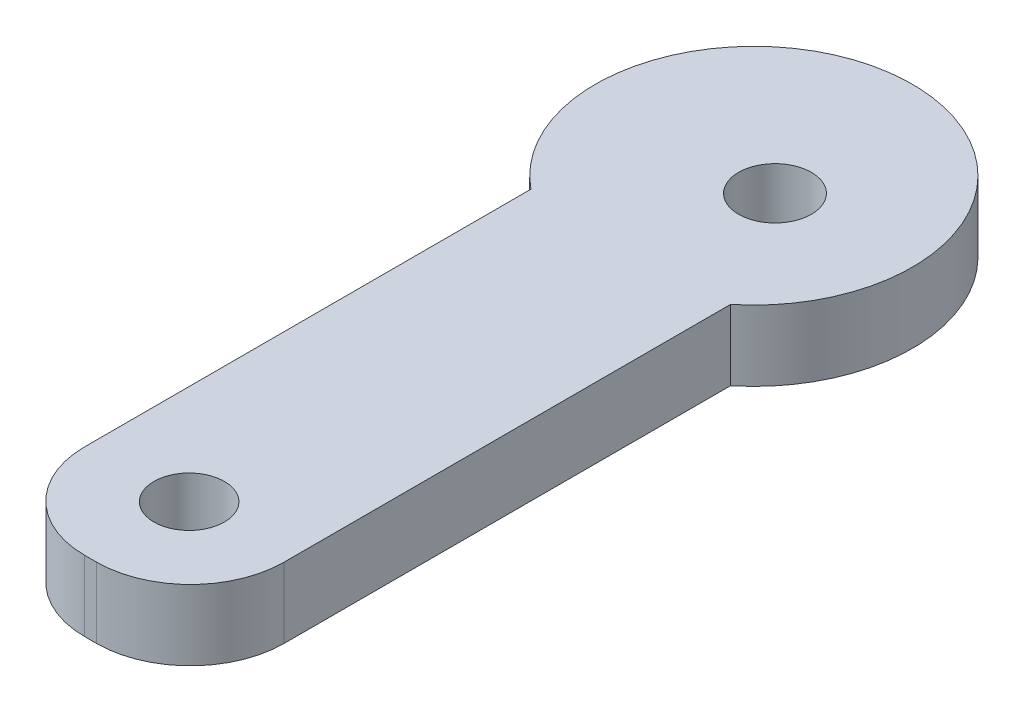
ISO-10303-21;
HEADER;
FILE_DESCRIPTION(('STEP AP214'),'2;1');
FILE_NAME('part.step','',(''),(''),'','','');
FILE_SCHEMA(('AUTOMOTIVE_DESIGN { 1 0 10303 214 1 1 1 1 }'));
ENDSEC;
DATA;
#1=APPLICATION_CONTEXT('core data for automotive mechanical design processes');
#2=APPLICATION_PROTOCOL_DEFINITION('international standard','automotive_design',2000,#1);
#3=PRODUCT_CONTEXT('',#1,'mechanical');
#4=PRODUCT('Part','Part','',(#3));
#5=PRODUCT_RELATED_PRODUCT_CATEGORY('part','',(#4));
#6=PRODUCT_DEFINITION_FORMATION('','',#4);
#7=PRODUCT_DEFINITION_CONTEXT('part definition',#1,'design');
#8=PRODUCT_DEFINITION('design','',#6,#7);
#9=PRODUCT_DEFINITION_SHAPE('','',#8);
#10=(LENGTH_UNIT() NAMED_UNIT(*) SI_UNIT(.MILLI.,.METRE.));
#11=(NAMED_UNIT(*) PLANE_ANGLE_UNIT() SI_UNIT($,.RADIAN.));
#12=(NAMED_UNIT(*) SI_UNIT($,.STERADIAN.) SOLID_ANGLE_UNIT());
#13=UNCERTAINTY_MEASURE_WITH_UNIT(LENGTH_MEASURE(1.E-05),#10,'distance_accuracy_value','');
#14=(GEOMETRIC_REPRESENTATION_CONTEXT(3) GLOBAL_UNCERTAINTY_ASSIGNED_CONTEXT((#13)) GLOBAL_UNIT_ASSIGNED_CONTEXT((#10,
#11,#12)) REPRESENTATION_CONTEXT('',''));
#15=CARTESIAN_POINT('',(0.,0.,0.));
#16=DIRECTION('',(0.,0.,1.));
#17=DIRECTION('',(1.,0.,0.));
#18=AXIS2_PLACEMENT_3D('',#15,#16,#17);
#19=CARTESIAN_POINT('',(-0.25,-1.5,17.5));
#20=DIRECTION('',(0.,0.,1.));
#21=DIRECTION('',(1.,0.,0.));
#22=AXIS2_PLACEMENT_3D('',#19,#20,#21);
#23=PLANE('',#22);
#24=DIRECTION('',(0.,1.,0.));
#25=VECTOR('',#24,1.);
#26=CARTESIAN_POINT('',(-0.25,-1.5,17.5));
#27=LINE('',#26,#25);
#28=CARTESIAN_POINT('',(-0.25,-1.5,17.5));
#29=VERTEX_POINT('',#28);
#30=CARTESIAN_POINT('',(-0.25,1.5,17.5));
#31=VERTEX_POINT('',#30);
#32=EDGE_CURVE('E117',#29,#31,#27,.T.);
#33=ORIENTED_EDGE('',*,*,#32,.F.);
#34=DIRECTION('',(1.,0.,0.));
#35=VECTOR('',#34,1.);
#36=CARTESIAN_POINT('',(-0.25,-1.5,17.5));
#37=LINE('',#36,#35);
#38=CARTESIAN_POINT('',(0.25,-1.5,17.5));
#39=VERTEX_POINT('',#38);
#40=EDGE_CURVE('E35',#29,#39,#37,.T.);
#41=ORIENTED_EDGE('',*,*,#40,.T.);
#42=DIRECTION('',(0.,1.,0.));
#43=VECTOR('',#42,1.);
#44=CARTESIAN_POINT('',(0.25,-1.5,17.5));
#45=LINE('',#44,#43);
#46=CARTESIAN_POINT('',(0.25,1.5,17.5));
#47=VERTEX_POINT('',#46);
#48=EDGE_CURVE('E86',#47,#39,#45,.F.);
#49=ORIENTED_EDGE('',*,*,#48,.F.);
#50=DIRECTION('',(1.,0.,0.));
#51=VECTOR('',#50,1.);
#52=CARTESIAN_POINT('',(0.,1.5,17.5));
#53=LINE('',#52,#51);
#54=EDGE_CURVE('E73',#31,#47,#53,.T.);
#55=ORIENTED_EDGE('',*,*,#54,.F.);
#56=EDGE_LOOP('',(#33,#41,#49,#55));
#57=FACE_BOUND('',#56,.T.);
#58=ADVANCED_FACE('F17',(#57),#23,.T.);
#59=CARTESIAN_POINT('',(0.,1.5,0.));
#60=DIRECTION('',(0.,1.,0.));
#61=DIRECTION('',(0.,0.,1.));
#62=AXIS2_PLACEMENT_3D('',#59,#60,#61);
#63=PLANE('',#62);
#64=CARTESIAN_POINT('',(1.1,1.5,-10.55));
#65=DIRECTION('',(0.,1.,0.));
#66=DIRECTION('',(0.,0.,1.));
#67=AXIS2_PLACEMENT_3D('',#64,#65,#66);
#68=CIRCLE('',#67,1.55);
#69=CARTESIAN_POINT('',(1.1,1.5,-9.));
#70=VERTEX_POINT('',#69);
#71=EDGE_CURVE('E110',#70,#70,#68,.F.);
#72=ORIENTED_EDGE('',*,*,#71,.T.);
#73=EDGE_LOOP('',(#72));
#74=FACE_BOUND('',#73,.T.);
#75=CARTESIAN_POINT('',(0.,1.5,13.3));
#76=DIRECTION('',(0.,1.,0.));
#77=DIRECTION('',(0.,0.,1.));
#78=AXIS2_PLACEMENT_3D('',#75,#76,#77);
#79=CIRCLE('',#78,1.5);
#80=CARTESIAN_POINT('',(0.,1.5,14.8));
#81=VERTEX_POINT('',#80);
#82=EDGE_CURVE('E113',#81,#81,#79,.F.);
#83=ORIENTED_EDGE('',*,*,#82,.T.);
#84=EDGE_LOOP('',(#83));
#85=FACE_BOUND('',#84,.T.);
#86=ORIENTED_EDGE('',*,*,#54,.T.);
#87=CARTESIAN_POINT('',(0.25,1.5,13.5));
#88=DIRECTION('',(0.,1.,0.));
#89=DIRECTION('',(0.,0.,1.));
#90=AXIS2_PLACEMENT_3D('',#87,#88,#89);
#91=CIRCLE('',#90,4.);
#92=CARTESIAN_POINT('',(4.25,1.5,13.5));
#93=VERTEX_POINT('',#92);
#94=EDGE_CURVE('E20',#93,#47,#91,.F.);
#95=ORIENTED_EDGE('',*,*,#94,.F.);
#96=DIRECTION('',(0.,0.,-1.));
#97=VECTOR('',#96,1.);
#98=CARTESIAN_POINT('',(4.25,1.5,13.5));
#99=LINE('',#98,#97);
#100=CARTESIAN_POINT('',(4.24999999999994,1.5,-5.5059557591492));
#101=VERTEX_POINT('',#100);
#102=EDGE_CURVE('E67',#101,#93,#99,.F.);
#103=ORIENTED_EDGE('',*,*,#102,.F.);
#104=CARTESIAN_POINT('',(0.,1.5,-10.75));
#105=DIRECTION('',(0.,1.,0.));
#106=DIRECTION('',(0.,0.,1.));
#107=AXIS2_PLACEMENT_3D('',#104,#105,#106);
#108=CIRCLE('',#107,6.75);
#109=CARTESIAN_POINT('',(-4.25,1.5,-5.50595575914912));
#110=VERTEX_POINT('',#109);
#111=EDGE_CURVE('E118',#110,#101,#108,.F.);
#112=ORIENTED_EDGE('',*,*,#111,.F.);
#113=DIRECTION('',(0.,0.,1.));
#114=VECTOR('',#113,1.);
#115=CARTESIAN_POINT('',(-4.25,1.5,-5.505955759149));
#116=LINE('',#115,#114);
#117=CARTESIAN_POINT('',(-4.25,1.5,13.5));
#118=VERTEX_POINT('',#117);
#119=EDGE_CURVE('E93',#118,#110,#116,.F.);
#120=ORIENTED_EDGE('',*,*,#119,.F.);
#121=CARTESIAN_POINT('',(-0.25,1.5,13.5));
#122=DIRECTION('',(0.,1.,0.));
#123=DIRECTION('',(0.,0.,1.));
#124=AXIS2_PLACEMENT_3D('',#121,#122,#123);
#125=CIRCLE('',#124,4.);
#126=EDGE_CURVE('E78',#31,#118,#125,.F.);
#127=ORIENTED_EDGE('',*,*,#126,.F.);
#128=EDGE_LOOP('',(#86,#95,#103,#112,#120,#127));
#129=FACE_BOUND('',#128,.T.);
#130=ADVANCED_FACE('F75',(#74,#85,#129),#63,.T.);
#131=CARTESIAN_POINT('',(0.25,-1.5,13.5));
#132=DIRECTION('',(0.,1.,0.));
#133=DIRECTION('',(0.,0.,1.));
#134=AXIS2_PLACEMENT_3D('',#131,#132,#133);
#135=CYLINDRICAL_SURFACE('',#134,4.);
#136=ORIENTED_EDGE('',*,*,#48,.T.);
#137=CARTESIAN_POINT('',(0.25,-1.5,13.5));
#138=DIRECTION('',(0.,1.,0.));
#139=DIRECTION('',(0.,0.,1.));
#140=AXIS2_PLACEMENT_3D('',#137,#138,#139);
#141=CIRCLE('',#140,4.);
#142=CARTESIAN_POINT('',(4.25,-1.5,13.5));
#143=VERTEX_POINT('',#142);
#144=EDGE_CURVE('E108',#39,#143,#141,.T.);
#145=ORIENTED_EDGE('',*,*,#144,.T.);
#146=DIRECTION('',(0.,1.,0.));
#147=VECTOR('',#146,1.);
#148=CARTESIAN_POINT('',(4.25,-1.5,13.5));
#149=LINE('',#148,#147);
#150=EDGE_CURVE('E87',#93,#143,#149,.F.);
#151=ORIENTED_EDGE('',*,*,#150,.F.);
#152=ORIENTED_EDGE('',*,*,#94,.T.);
#153=EDGE_LOOP('',(#136,#145,#151,#152));
#154=FACE_BOUND('',#153,.T.);
#155=ADVANCED_FACE('F84',(#154),#135,.T.);
#156=CARTESIAN_POINT('',(4.25,-1.5,13.5));
#157=DIRECTION('',(1.,0.,0.));
#158=DIRECTION('',(0.,0.,-1.));
#159=AXIS2_PLACEMENT_3D('',#156,#157,#158);
#160=PLANE('',#159);
#161=ORIENTED_EDGE('',*,*,#150,.T.);
#162=DIRECTION('',(0.,0.,1.));
#163=VECTOR('',#162,1.);
#164=CARTESIAN_POINT('',(4.25,-1.5,0.));
#165=LINE('',#164,#163);
#166=CARTESIAN_POINT('',(4.24999999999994,-1.5,-5.5059557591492));
#167=VERTEX_POINT('',#166);
#168=EDGE_CURVE('E107',#143,#167,#165,.F.);
#169=ORIENTED_EDGE('',*,*,#168,.T.);
#170=DIRECTION('',(0.,1.,0.));
#171=VECTOR('',#170,1.);
#172=CARTESIAN_POINT('',(4.24999999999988,-1.5,-5.50595575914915));
#173=LINE('',#172,#171);
#174=EDGE_CURVE('E96',#101,#167,#173,.F.);
#175=ORIENTED_EDGE('',*,*,#174,.F.);
#176=ORIENTED_EDGE('',*,*,#102,.T.);
#177=EDGE_LOOP('',(#161,#169,#175,#176));
#178=FACE_BOUND('',#177,.T.);
#179=ADVANCED_FACE('F124',(#178),#160,.T.);
#180=CARTESIAN_POINT('',(0.,-1.5,-10.75));
#181=DIRECTION('',(0.,1.,0.));
#182=DIRECTION('',(0.,0.,1.));
#183=AXIS2_PLACEMENT_3D('',#180,#181,#182);
#184=CYLINDRICAL_SURFACE('',#183,6.75);
#185=ORIENTED_EDGE('',*,*,#174,.T.);
#186=CARTESIAN_POINT('',(0.,-1.5,-10.75));
#187=DIRECTION('',(0.,1.,0.));
#188=DIRECTION('',(0.,0.,1.));
#189=AXIS2_PLACEMENT_3D('',#186,#187,#188);
#190=CIRCLE('',#189,6.75);
#191=CARTESIAN_POINT('',(-4.25,-1.5,-5.50595575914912));
#192=VERTEX_POINT('',#191);
#193=EDGE_CURVE('E104',#167,#192,#190,.T.);
#194=ORIENTED_EDGE('',*,*,#193,.T.);
#195=DIRECTION('',(0.,1.,0.));
#196=VECTOR('',#195,1.);
#197=CARTESIAN_POINT('',(-4.25,-1.5,-5.505955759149));
#198=LINE('',#197,#196);
#199=EDGE_CURVE('E95',#110,#192,#198,.F.);
#200=ORIENTED_EDGE('',*,*,#199,.F.);
#201=ORIENTED_EDGE('',*,*,#111,.T.);
#202=EDGE_LOOP('',(#185,#194,#200,#201));
#203=FACE_BOUND('',#202,.T.);
#204=ADVANCED_FACE('F137',(#203),#184,.T.);
#205=CARTESIAN_POINT('',(-4.25,-1.5,-5.505955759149));
#206=DIRECTION('',(-1.,0.,0.));
#207=DIRECTION('',(0.,0.,1.));
#208=AXIS2_PLACEMENT_3D('',#205,#206,#207);
#209=PLANE('',#208);
#210=ORIENTED_EDGE('',*,*,#199,.T.);
#211=DIRECTION('',(0.,0.,1.));
#212=VECTOR('',#211,1.);
#213=CARTESIAN_POINT('',(-4.25,-1.5,0.));
#214=LINE('',#213,#212);
#215=CARTESIAN_POINT('',(-4.25,-1.5,13.5));
#216=VERTEX_POINT('',#215);
#217=EDGE_CURVE('E103',#192,#216,#214,.T.);
#218=ORIENTED_EDGE('',*,*,#217,.T.);
#219=DIRECTION('',(0.,1.,0.));
#220=VECTOR('',#219,1.);
#221=CARTESIAN_POINT('',(-4.25,-1.5,13.5));
#222=LINE('',#221,#220);
#223=EDGE_CURVE('E116',#118,#216,#222,.F.);
#224=ORIENTED_EDGE('',*,*,#223,.F.);
#225=ORIENTED_EDGE('',*,*,#119,.T.);
#226=EDGE_LOOP('',(#210,#218,#224,#225));
#227=FACE_BOUND('',#226,.T.);
#228=ADVANCED_FACE('F135',(#227),#209,.T.);
#229=CARTESIAN_POINT('',(-0.25,-1.5,13.5));
#230=DIRECTION('',(0.,1.,0.));
#231=DIRECTION('',(0.,0.,1.));
#232=AXIS2_PLACEMENT_3D('',#229,#230,#231);
#233=CYLINDRICAL_SURFACE('',#232,4.);
#234=ORIENTED_EDGE('',*,*,#223,.T.);
#235=CARTESIAN_POINT('',(-0.25,-1.5,13.5));
#236=DIRECTION('',(0.,1.,0.));
#237=DIRECTION('',(0.,0.,1.));
#238=AXIS2_PLACEMENT_3D('',#235,#236,#237);
#239=CIRCLE('',#238,4.);
#240=EDGE_CURVE('E100',#216,#29,#239,.T.);
#241=ORIENTED_EDGE('',*,*,#240,.T.);
#242=ORIENTED_EDGE('',*,*,#32,.T.);
#243=ORIENTED_EDGE('',*,*,#126,.T.);
#244=EDGE_LOOP('',(#234,#241,#242,#243));
#245=FACE_BOUND('',#244,.T.);
#246=ADVANCED_FACE('F145',(#245),#233,.T.);
#247=CARTESIAN_POINT('',(0.,-1.5,13.3));
#248=DIRECTION('',(0.,1.,0.));
#249=DIRECTION('',(0.,0.,1.));
#250=AXIS2_PLACEMENT_3D('',#247,#248,#249);
#251=CYLINDRICAL_SURFACE('',#250,1.5);
#252=ORIENTED_EDGE('',*,*,#82,.F.);
#253=EDGE_LOOP('',(#252));
#254=FACE_BOUND('',#253,.T.);
#255=CARTESIAN_POINT('',(0.,-1.5,13.3));
#256=DIRECTION('',(0.,1.,0.));
#257=DIRECTION('',(0.,0.,1.));
#258=AXIS2_PLACEMENT_3D('',#255,#256,#257);
#259=CIRCLE('',#258,1.5);
#260=CARTESIAN_POINT('',(0.,-1.5,14.8));
#261=VERTEX_POINT('',#260);
#262=EDGE_CURVE('E26',#261,#261,#259,.F.);
#263=ORIENTED_EDGE('',*,*,#262,.T.);
#264=EDGE_LOOP('',(#263));
#265=FACE_BOUND('',#264,.T.);
#266=ADVANCED_FACE('F155',(#254,#265),#251,.F.);
#267=CARTESIAN_POINT('',(1.1,-1.5,-10.55));
#268=DIRECTION('',(0.,1.,0.));
#269=DIRECTION('',(0.,0.,1.));
#270=AXIS2_PLACEMENT_3D('',#267,#268,#269);
#271=CYLINDRICAL_SURFACE('',#270,1.55);
#272=ORIENTED_EDGE('',*,*,#71,.F.);
#273=EDGE_LOOP('',(#272));
#274=FACE_BOUND('',#273,.T.);
#275=CARTESIAN_POINT('',(1.1,-1.5,-10.55));
#276=DIRECTION('',(0.,1.,0.));
#277=DIRECTION('',(0.,0.,1.));
#278=AXIS2_PLACEMENT_3D('',#275,#276,#277);
#279=CIRCLE('',#278,1.55);
#280=CARTESIAN_POINT('',(1.1,-1.5,-9.));
#281=VERTEX_POINT('',#280);
#282=EDGE_CURVE('E11',#281,#281,#279,.F.);
#283=ORIENTED_EDGE('',*,*,#282,.T.);
#284=EDGE_LOOP('',(#283));
#285=FACE_BOUND('',#284,.T.);
#286=ADVANCED_FACE('F149',(#274,#285),#271,.F.);
#287=CARTESIAN_POINT('',(0.,-1.5,0.));
#288=DIRECTION('',(0.,1.,0.));
#289=DIRECTION('',(0.,0.,1.));
#290=AXIS2_PLACEMENT_3D('',#287,#288,#289);
#291=PLANE('',#290);
#292=ORIENTED_EDGE('',*,*,#282,.F.);
#293=EDGE_LOOP('',(#292));
#294=FACE_BOUND('',#293,.T.);
#295=ORIENTED_EDGE('',*,*,#262,.F.);
#296=EDGE_LOOP('',(#295));
#297=FACE_BOUND('',#296,.T.);
#298=ORIENTED_EDGE('',*,*,#240,.F.);
#299=ORIENTED_EDGE('',*,*,#217,.F.);
#300=ORIENTED_EDGE('',*,*,#193,.F.);
#301=ORIENTED_EDGE('',*,*,#168,.F.);
#302=ORIENTED_EDGE('',*,*,#144,.F.);
#303=ORIENTED_EDGE('',*,*,#40,.F.);
#304=EDGE_LOOP('',(#298,#299,#300,#301,#302,#303));
#305=FACE_BOUND('',#304,.T.);
#306=ADVANCED_FACE('F126',(#294,#297,#305),#291,.F.);
#307=CLOSED_SHELL('',(#58,#130,#155,#179,#204,#228,#246,#266,#286,#306));
#308=MANIFOLD_SOLID_BREP('B1',#307);
#309=ADVANCED_BREP_SHAPE_REPRESENTATION('',(#18,#308),#14);
#310=SHAPE_DEFINITION_REPRESENTATION(#9,#309);
ENDSEC;
END-ISO-10303-21;
